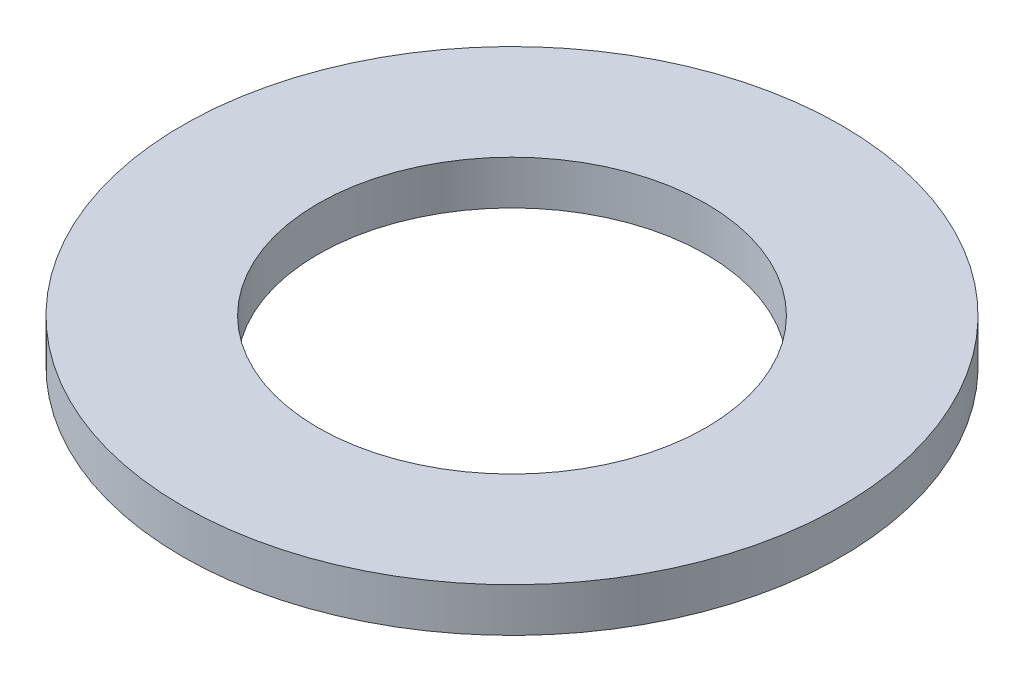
from build123d import *

# Parameters (mm, degrees)
ESQUISSE1_W = 1.85
ESQUISSE1_H = 0.6


with BuildPart() as part:
    # Esquisse1 → R_volution2 (revolve)
    with BuildSketch(Plane.XY, mode=Mode.PRIVATE) as r_volution2_sk:
        with Locations((3.575, 0.3)):
            Rectangle(ESQUISSE1_W, ESQUISSE1_H)
    revolve(r_volution2_sk.sketch.rotate(Axis((0, 0, 0), (0, 1, 0)), 90), axis=Axis((0, 0, 0), (0, 1, 0)))


solid = part.part
